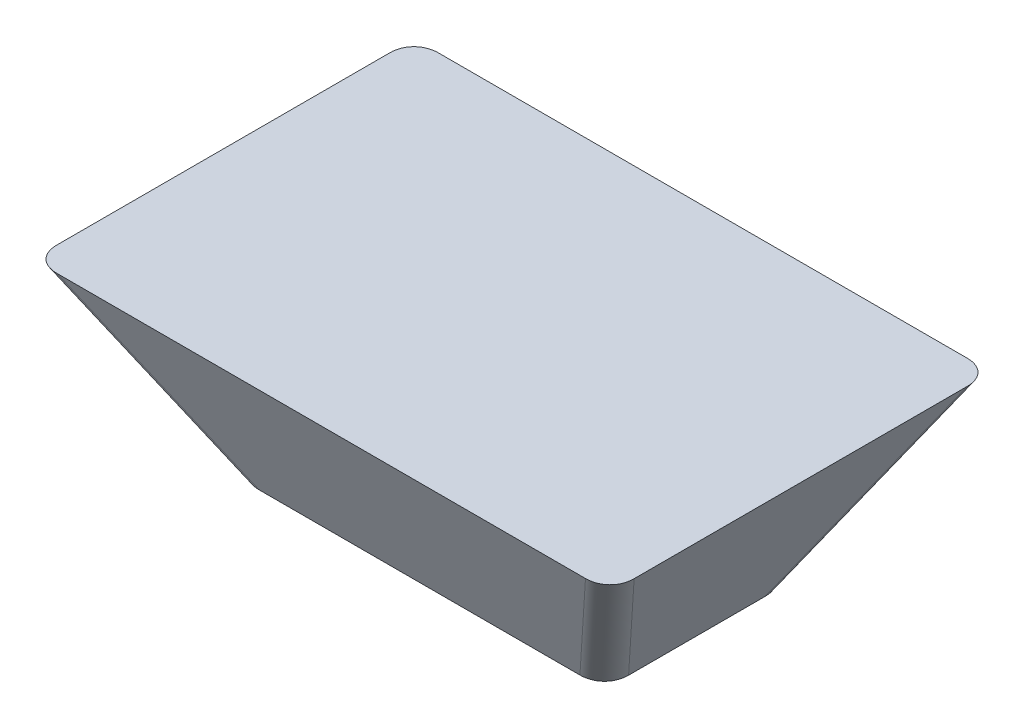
from build123d import *

# Parameters (mm, degrees)
FILLET1_R = 7.62


with BuildPart() as part:
    # Sketch4 → Loft1 section 0
    with BuildSketch(Plane(origin=(0, 50.8, 0), x_dir=(1, 0, 0), z_dir=(0, 1, 0))):
        with BuildLine():
            Line((-79.375, -52.451), (79.375, -52.451))
            Line((79.375, -52.451), (79.375, 52.451))
            Line((79.375, 52.451), (-79.375, 52.451))
            Line((-79.375, 52.451), (-79.375, -52.451))
        make_face()
    # Sketch5 → Loft1 section 1
    with BuildSketch(Plane(origin=(0, 0, 0), x_dir=(1, 0, 0), z_dir=(0, 1, 0))):
        with BuildLine():
            Line((50.8, -25.4), (50.8, 25.4))
            Line((50.8, 25.4), (-50.8, 25.4))
            Line((-50.8, 25.4), (-50.8, -25.4))
            Line((-50.8, -25.4), (50.8, -25.4))
        make_face()
    loft()

    # Fillet1
    fillet1_edges = [part.edges().sort_by_distance(p)[0] for p in [
        (65.0875, 25.4, 38.9255),
        (65.0875, 25.4, -38.9255),
        (-65.0875, 25.4, -38.9255),
        (-65.0875, 25.4, 38.9255),
    ]]
    fillet(fillet1_edges, radius=FILLET1_R)


solid = part.part
